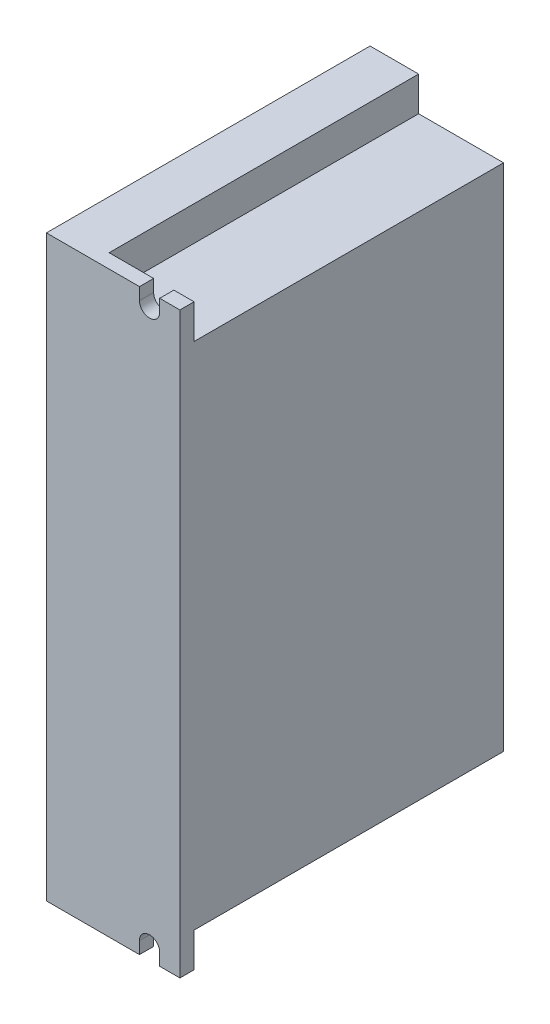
from build123d import *

# Parameters (mm, degrees)
SKETCH_1_W          = 80
SKETCH_1_H          = 143
EXTRUDE_1_DEPTH     = 33
SKETCH_2_W          = 76.5
SKETCH_2_H          = 8.5
CUT_EXTRUDE_1_DEPTH = 21
CUT_EXTRUDE_2_DEPTH = 3.5


with BuildPart() as part:
    # Sketch 1 → Extrude 1 (new body)
    with BuildSketch(Plane(origin=(0, 0, 0), x_dir=(0, 0, -1), z_dir=(1, 0, 0))):
        Rectangle(SKETCH_1_W, SKETCH_1_H)
    extrude(amount=EXTRUDE_1_DEPTH)

    # Sketch 2 → Cut-Extrude 1 (cut)
    with BuildSketch(Plane(origin=(33, 0, 0), x_dir=(0, 0, -1), z_dir=(1, 0, 0))):
        with Locations((1.75, -67.25)):
            Rectangle(SKETCH_2_W, SKETCH_2_H)
        with Locations((1.75, 67.25)):
            Rectangle(SKETCH_2_W, SKETCH_2_H)
    extrude(amount=-CUT_EXTRUDE_1_DEPTH, mode=Mode.SUBTRACT)

    # Sketch 3 → Cut-Extrude 2 (cut)
    with BuildSketch(Plane(origin=(0, 0, 36.5), x_dir=(-1, 0, 0), z_dir=(0, 0, -1))):
        with BuildLine():
            Line((-23, -68.5), (-23, -71.5))
            Line((-23, -71.5), (-28, -71.5))
            Line((-28, -71.5), (-28, -68.5))
            ThreePointArc((-28, -68.5), (-25.5, -66), (-23, -68.5))
        make_face()
        with BuildLine():
            Line((-23, 68.5), (-23, 71.5))
            Line((-23, 71.5), (-28, 71.5))
            Line((-28, 71.5), (-28, 68.5))
            ThreePointArc((-28, 68.5), (-25.5, 66), (-23, 68.5))
        make_face()
    extrude(amount=-CUT_EXTRUDE_2_DEPTH, mode=Mode.SUBTRACT)


solid = part.part
